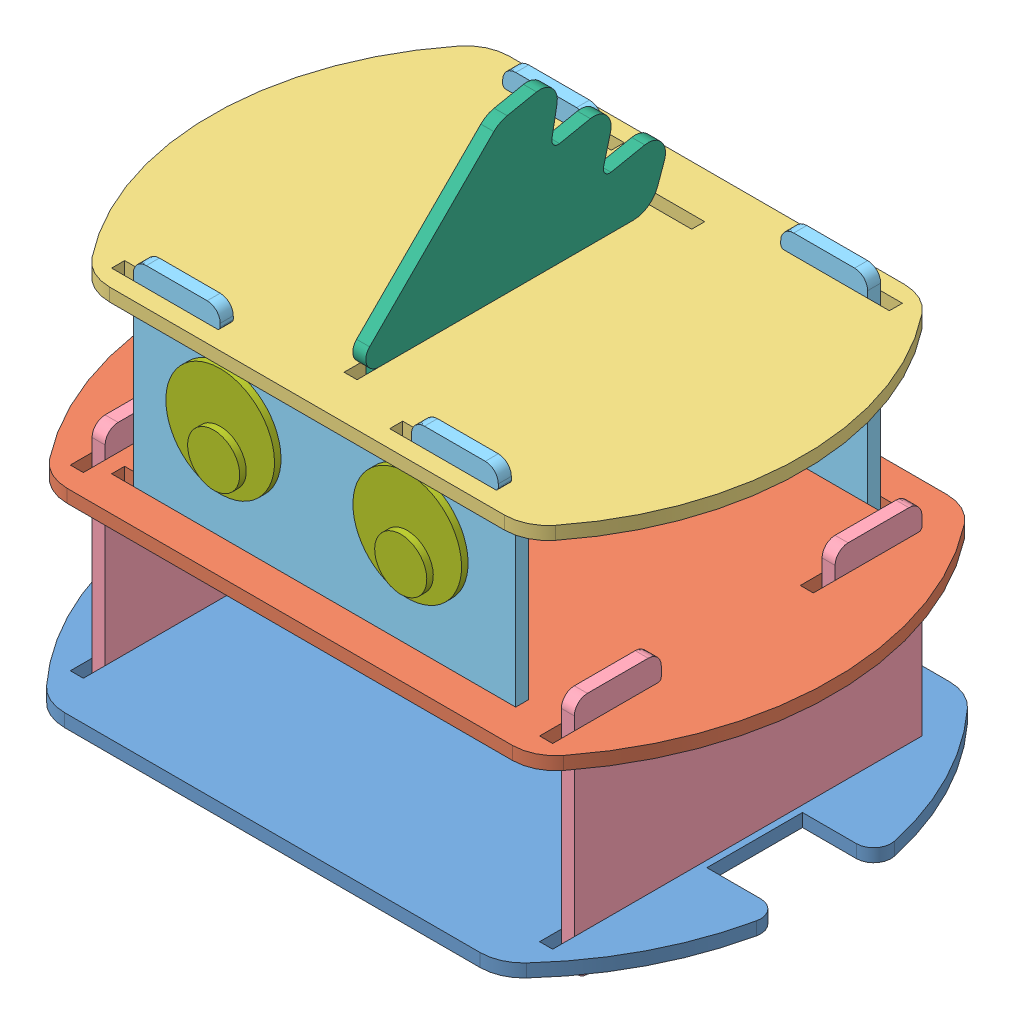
SolidWorks assembly fullAssem.SLDASM, configuration Default (file format 15000). Lengths in mm.
Overall size (201 169.29 108).
18 component instances, 12 part files, 47 mates.
Components (placement in the parent):
- wheel-2: wheel.SLDPRT [Default] at (65.8975 34.6461 36.6643) x (0 1 0) z (0 0 1) size (67 25 67)
- motor-1: motor.SLDPRT [Default] at (22.3975 89.6461 47.6643) x (0 -1 0) z (0 0 1) size (65 35 22)
- base-1: base.SLDPRT [Default] at (-34.6025 48.6461 36.6643) size (146.79 3 108)
- wheel-3: wheel.SLDPRT [Default] at (-135.1025 34.6461 36.6643) x (0 -1 0) z (0 0 1) size (67 25 67)
- motor-2: motor.SLDPRT [Default] at (-109.6025 89.6461 47.6643) x (0 -1 0) z (0 0 1) size (65 35 22)
- batteryPack-1: batteryPack.SLDPRT [Default] at (7.3975 72.6461 -9.0857) x (0 0 1) z (1 0 0) size (91.5 21 41)
- batteryPack-2: batteryPack.SLDPRT [Default] at (-35.6025 72.6461 -9.0857) x (0 0 1) z (1 0 0) size (91.5 21 41)
- midPlate-1: midPlate.SLDPRT [Default] at (-34.6025 89.6461 36.6643) size (150 3 100)
- topPlate-1: topPlate.SLDPRT [Default] at (-34.6025 130.6461 36.6643) size (136 3 92)
- arduino-2: arduino.SLDPRT [Default] at (15.8975 92.6461 69.6643) x (0 0 -1) z (1 0 0) size (66 14 53)
- motorDriver-1: motorDriver.SLDPRT [Default] at (-85.1025 92.6461 58.1643) size (43 29 43)
- sidePart-2: sidePart.SLDPRT [Default] at (-87.1025 51.6461 76.6643) x (0 1 0) z (0 0 1) size (56 3 80)
- sidePart-3: sidePart.SLDPRT [Default] at (20.8975 51.6461 76.6643) x (0 1 0) z (0 0 1) size (56 3 80)
- frontBackPlate-1: frontBackPlate.SLDPRT [Default] at (9.3975 92.6461 78.6643) x (-1 0 0) z (0 -1 0) size (88 3 53)
- frontBackPlate-2: frontBackPlate.SLDPRT [Default] at (-78.6025 92.6461 -5.3357) x (1 0 0) z (0 -1 0) size (88 3 53)
- mohawk-1: mohawk.SLDPRT [Default] at (-36.1025 133.6461 74.907) x (0 0 -1) z (0 -1 0) size (69 3 43.79)
- eyes-1: eyes.SLDPRT [Default] at (-57.1121 115.1284 78.6643) x (1 0 0) z (0 -1 0) size (25 3 25)
- eyes-2: eyes.SLDPRT [Default] at (-14.0618 115.8903 78.6643) x (1 0 0) z (0 -1 0) size (25 3 25)
Mates (geometry in assembly coordinates):
- Concentric1: concentric aligned: cylinder of wheel-2 through (48.8975 34.6461 36.6643) axis (-1 0 0) radius 2.5; cylinder of motor-1 through (48.8975 34.6461 36.6643) axis (-1 0 0) radius 2.5
- Coincident1: coincident anti-aligned: plane of wheel-2 through (48.8975 34.6461 36.6643) normal (-1 0 0); plane of motor-1 through (48.8975 34.6461 36.6643) normal (1 0 0)
- Coincident3: coincident anti-aligned: plane of motor-1 through (22.3975 89.6461 47.6643) normal (-1 0 0); plane of base-1 through (22.3975 51.6461 25.6643) normal (1 0 0)
- Coincident4: coincident anti-aligned: plane of motor-1 through (40.3975 89.6461 25.6643) normal (0 0 -1); plane of base-1 through (39.5864 51.6461 25.6643) normal (0 0 1)
- Concentric2: concentric aligned: cylinder of wheel-3 through (-118.1025 34.6461 36.6643) axis (1 0 0) radius 2.5; cylinder of motor-2 through (-118.1025 34.6461 36.6643) axis (1 0 0) radius 2.5
- Coincident5: coincident anti-aligned: plane of wheel-3 through (-118.1025 34.6461 36.6643) normal (1 0 0); plane of motor-2 through (-118.1025 34.6461 36.6643) normal (-1 0 0)
- Coincident6: coincident anti-aligned: plane of base-1 through (-91.6025 51.6461 25.6643) normal (-1 0 0); plane of motor-2 through (-91.6025 89.6461 47.6643) normal (1 0 0)
- Coincident7: coincident anti-aligned: plane of base-1 through (-108.7915 51.6461 25.6643) normal (0 0 1); plane of motor-2 through (-91.6025 89.6461 25.6643) normal (0 0 -1)
- Coincident8: coincident aligned: plane of motor-1 through (40.3975 24.6461 47.6643) normal (0 -1 0); plane of motor-2 through (-91.6025 24.6461 47.6643) normal (0 -1 0)
- Coincident9: coincident anti-aligned: plane of base-1 through (-34.6025 51.6461 36.6643) normal (0 1 0); plane of batteryPack-2 through (-35.6025 51.6461 -9.0857) normal (0 -1 0)
- Coincident10: coincident anti-aligned: plane of base-1 through (-34.6025 51.6461 36.6643) normal (0 1 0); plane of batteryPack-1 through (7.3975 51.6461 -9.0857) normal (0 -1 0)
- Distance1: distance = 8.25 mm aligned: plane of batteryPack-1 through (7.3975 51.6461 -9.0857) normal (0 0 -1); plane of base-1 through (-86.6506 51.6461 -17.3357) normal (0 0 -1)
- Distance2: distance = 8.25 mm aligned: plane of batteryPack-2 through (-35.6025 51.6461 -9.0857) normal (0 0 -1); plane of base-1 through (-86.6506 51.6461 -17.3357) normal (0 0 -1)
- Distance3: distance = 15 mm aligned: plane of batteryPack-2 through (-76.6025 51.6461 -9.0857) normal (-1 0 0); plane of base-1 through (-91.6025 51.6461 25.6643) normal (-1 0 0)
- Distance4: distance = 15 mm aligned: plane of batteryPack-1 through (7.3975 51.6461 -9.0857) normal (1 0 0); plane of base-1 through (22.3975 51.6461 25.6643) normal (1 0 0)
- Distance5: distance = 24 mm aligned: plane of motor-1 through (40.3975 24.6461 47.6643) normal (0 -1 0); plane of base-1 through (-34.6025 48.6461 36.6643) normal (0 -1 0)
- Parallel2: parallel anti-aligned: plane of base-1 through (-34.6025 51.6461 36.6643) normal (0 1 0); plane of midPlate-1 through (-34.6025 89.6461 36.6643) normal (0 -1 0)
- Coincident17: coincident: line of base-1 through (13.241 51.6461 -17.3357) axis (-1 0 0); plane of midPlate-1 through (-86.6506 96.6461 -17.3357) normal (0 0 -1)
- Distance6: distance = 38 mm anti-aligned: plane of midPlate-1 through (-34.6025 89.6461 36.6643) normal (0 -1 0); plane of base-1 through (-34.6025 51.6461 36.6643) normal (0 1 0)
- Coincident19: coincident: plane of midPlate-1 through (-86.6506 96.6461 -17.3357) normal (0 0 -1); plane of topPlate-1 through (-86.6506 137.6461 -17.3357) normal (0 0 -1)
- Parallel3: parallel anti-aligned: plane of midPlate-1 through (-34.6025 92.6461 36.6643) normal (0 1 0); plane of topPlate-1 through (-34.6025 130.6461 36.6643) normal (0 -1 0)
- Concentric3: concentric: cylinder of midPlate-1 through (-34.6025 92.6461 36.6643) axis (0 -1 0) radius 75; cylinder of topPlate-1 through (-34.6025 137.6461 36.6643) axis (0 -1 0) radius 75
- Distance7: distance = 38 mm anti-aligned: plane of midPlate-1 through (-34.6025 92.6461 36.6643) normal (0 1 0); plane of topPlate-1 through (-34.6025 130.6461 36.6643) normal (0 -1 0)
- Coincident22: coincident anti-aligned: plane of midPlate-1 through (-34.6025 92.6461 36.6643) normal (0 1 0); plane of motorDriver-1 through (-85.1025 92.6461 58.1643) normal (0 -1 0)
- Coincident23: coincident anti-aligned: plane of midPlate-1 through (-34.6025 92.6461 36.6643) normal (0 1 0); plane of arduino-2 through (15.8975 92.6461 69.6643) normal (0 -1 0)
- Distance8: distance = 21 mm: plane of arduino-2 through (15.8975 106.6461 69.6643) normal (0 0 1); plane of midPlate-1 through (-86.6506 96.6461 90.6643) normal (0 0 1)
- Distance9: distance = 32.5 mm: plane of midPlate-1 through (-86.6506 96.6461 90.6643) normal (0 0 1); plane of motorDriver-1 through (-85.1025 125.6461 58.1643) normal (0 0 1)
- Distance10: distance = 24.5 mm: point of arduino-2; moEndPointRef_w of midPlate-1
- Distance11: distance = 24.5 mm: plane of motorDriver-1 through (-85.1025 121.6461 58.1643) normal (-1 0 0); unknown of midPlate-1
- Coincident31: coincident: line of base-1 through (17.4456 55.6461 90.6643) axis (0 -1 0); line of midPlate-1 through (17.4456 96.6461 90.6643) axis (0 -1 0)
- Coincident32: coincident anti-aligned: plane of base-1 through (-34.6025 51.6461 36.6643) normal (0 1 0); plane of sidePart-2 through (-90.1025 51.6461 61.6643) normal (0 -1 0)
- Coincident33: coincident anti-aligned: plane of base-1 through (-87.1025 41.6461 61.6643) normal (0 0 1); plane of sidePart-2 through (-90.1025 51.6461 61.6643) normal (0 0 -1)
- Coincident34: coincident anti-aligned: plane of base-1 through (-87.1025 41.6461 61.6643) normal (-1 0 0); plane of sidePart-2 through (-87.1025 51.6461 76.6643) normal (1 0 0)
- Coincident35: coincident anti-aligned: plane of base-1 through (-34.6025 51.6461 36.6643) normal (0 1 0); plane of sidePart-3 through (17.8975 51.6461 61.6643) normal (0 -1 0)
- Coincident36: coincident anti-aligned: plane of base-1 through (17.8975 41.6461 1.6643) normal (0 0 1); plane of sidePart-3 through (17.8975 51.6461 1.6643) normal (0 0 -1)
- Coincident37: coincident anti-aligned: plane of base-1 through (17.8975 41.6461 1.6643) normal (1 0 0); plane of sidePart-3 through (17.8975 51.6461 76.6643) normal (-1 0 0)
- Coincident38: coincident anti-aligned: plane of midPlate-1 through (-34.6025 92.6461 36.6643) normal (0 1 0); plane of frontBackPlate-1 through (-14.6025 92.6461 75.6643) normal (0 -1 0)
- Coincident39: coincident anti-aligned: plane of midPlate-1 through (-63.6025 89.6461 75.6643) normal (-1 0 0); plane of frontBackPlate-1 through (-63.6025 92.6461 75.6643) normal (1 0 0)
- Coincident40: coincident anti-aligned: plane of midPlate-1 through (-83.6025 89.6461 75.6643) normal (0 0 1); plane of frontBackPlate-1 through (9.3975 92.6461 75.6643) normal (0 0 -1)
- Coincident41: coincident anti-aligned: plane of midPlate-1 through (-34.6025 92.6461 36.6643) normal (0 1 0); plane of frontBackPlate-2 through (-54.6025 92.6461 -2.3357) normal (0 -1 0)
- Coincident42: coincident anti-aligned: plane of midPlate-1 through (-5.6025 89.6461 -5.3357) normal (1 0 0); plane of frontBackPlate-2 through (-5.6025 92.6461 -2.3357) normal (-1 0 0)
- Coincident43: coincident anti-aligned: plane of midPlate-1 through (-5.6025 89.6461 -2.3357) normal (0 0 -1); plane of frontBackPlate-2 through (-78.6025 92.6461 -2.3357) normal (0 0 1)
- Coincident44: coincident anti-aligned: plane of topPlate-1 through (-34.6025 133.6461 36.6643) normal (0 1 0); plane of mohawk-1 through (-33.1025 133.6461 52.6643) normal (0 -1 0)
- Coincident45: coincident anti-aligned: plane of topPlate-1 through (-36.1025 123.6461 52.6643) normal (0 0 1); plane of mohawk-1 through (-33.1025 133.6461 52.6643) normal (0 0 -1)
- Coincident46: coincident anti-aligned: plane of topPlate-1 through (-33.1025 123.6461 72.6643) normal (-1 0 0); plane of mohawk-1 through (-33.1025 143.4233 5.6651) normal (1 0 0)
- Coincident48: coincident anti-aligned: plane of frontBackPlate-1 through (9.3975 92.6461 78.6643) normal (0 0 1); plane of eyes-2 through (-14.0618 115.8903 78.6643) normal (0 0 -1)
- Coincident49: coincident anti-aligned: plane of frontBackPlate-1 through (9.3975 92.6461 78.6643) normal (0 0 1); plane of eyes-1 through (-57.1121 115.1284 78.6643) normal (0 0 -1)
